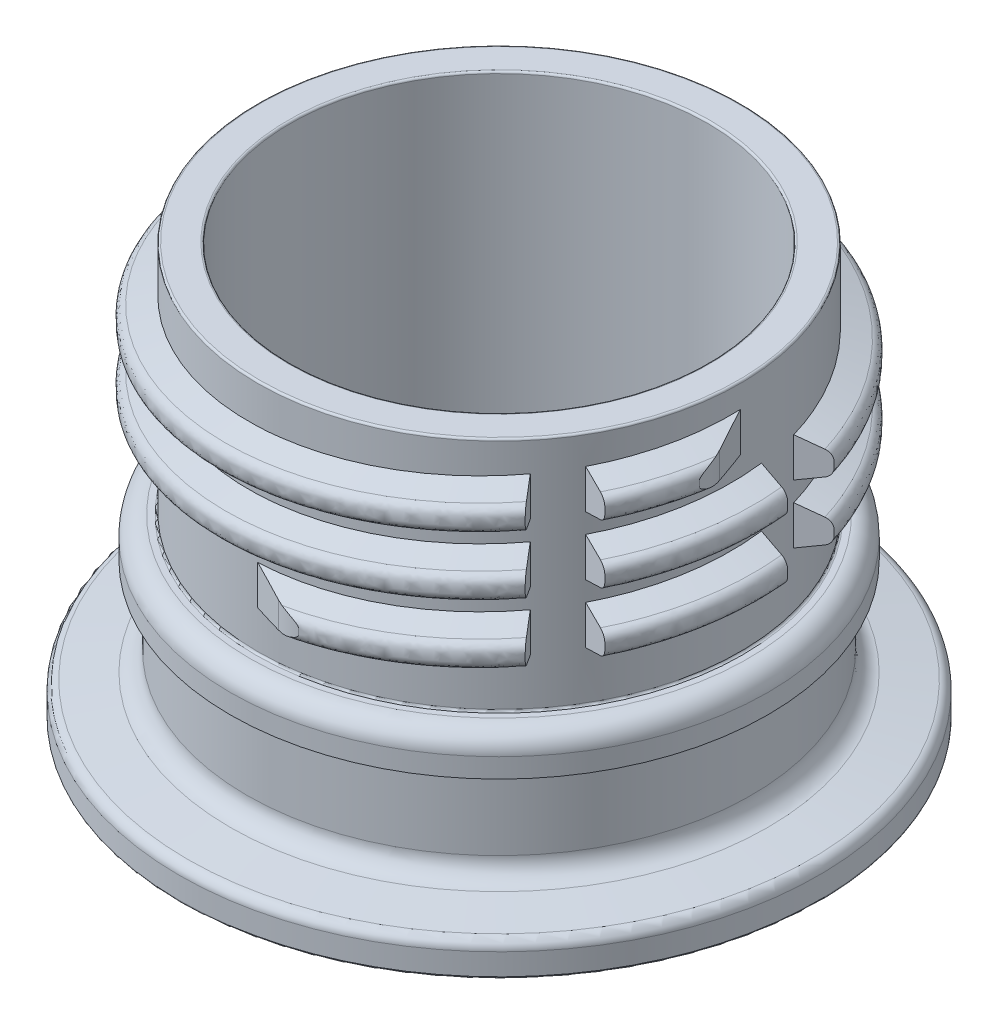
from build123d import *

# Parameters (mm, degrees)
BALAYAGE1_PITCH              = 3
BALAYAGE1_HEIGHT             = 6.75
BALAYAGE1_RADIUS             = 12.3
ENL_V_MAT_EXTRU_1_DEPTH      = 21.998675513
ENL_V_MAT_EXTRU_1_DEPTH_BACK = 21.998675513
ENL_V_MAT_EXTRU_2_DEPTH      = 1.5
ENL_V_MAT_EXTRU_2_DEPTH_BACK = 1.5
ENL_V_MAT_EXTRU_3_DEPTH      = 1.5
ENL_V_MAT_EXTRU_3_DEPTH_BACK = 1.5


with BuildPart() as part:
    # Balayage1: sweep along a helix
    with BuildLine() as balayage1_path:
        Helix(BALAYAGE1_PITCH, BALAYAGE1_HEIGHT, BALAYAGE1_RADIUS, center=(0, 0, 0), direction=(0, 1, 0))
    # Esquisse2 → Balayage1 (sweep)
    with BuildSketch(Plane.XY):
        with BuildLine():
            Line((12.299999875, 7.75), (12.299999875, 5.75))
            Line((12.299999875, 5.75), (13.458113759, 6.136037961))
            ThreePointArc((13.458113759, 6.136037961), (13.705620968, 6.318024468), (13.799999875, 6.61037961))
            Line((13.799999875, 6.61037961), (13.799999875, 6.88962039))
            ThreePointArc((13.799999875, 6.88962039), (13.705620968, 7.181975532), (13.458113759, 7.363962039))
            Line((13.458113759, 7.363962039), (12.299999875, 7.75))
        make_face()
    sweep(path=balayage1_path.line, is_frenet=True)

    # Esquisse3 → Enl_v. mat.-Extru.1 (cut, two sides: drawn at the far end of the back side and taken through both)
    with BuildSketch(Plane(origin=(0, 0, 0), x_dir=(1, 0, 0), z_dir=(0, 1, 0)).offset(-ENL_V_MAT_EXTRU_1_DEPTH_BACK)):
        Polygon((13.334220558, 3.848909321), (11.794343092, 3.069674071), (12.13469352, 1.139450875), (13.848219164, 0.933878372), align=None)
        Polygon((12.15030766, -6.707127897), (10.510447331, -6.169272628), (9.386237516, -7.774810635), (10.452521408, -9.131817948), align=None)
        Polygon((-12.15030766, 6.707127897), (-10.510447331, 6.169272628), (-9.386237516, 7.774810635), (-10.452521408, 9.131817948), align=None)
        Polygon((-13.334220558, -3.848909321), (-11.794343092, -3.069674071), (-12.13469352, -1.139450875), (-13.848219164, -0.933878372), align=None)
    extrude(amount=ENL_V_MAT_EXTRU_1_DEPTH + ENL_V_MAT_EXTRU_1_DEPTH_BACK, mode=Mode.SUBTRACT)


with BuildPart() as enl_v_mat_extru_1_piece_1:
    # of the separate pieces the step leaves, piece 1, a body of its own (enl_v_mat_extru_1_pieces)
    add(part.part.solids().sort_by_distance((-11.897274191, 6.372522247, 3.121761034))[0])



with BuildPart() as enl_v_mat_extru_1_piece_2:
    # of the separate pieces the step leaves, piece 2, a body of its own (enl_v_mat_extru_1_pieces)
    add(part.part.solids().sort_by_distance((11.89725975, 1.872523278, -3.121753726))[0])


with BuildPart() as enl_v_mat_extru_1_piece_3:
    # of the separate pieces the step leaves, piece 3, a body of its own (enl_v_mat_extru_1_pieces)
    add(part.part.solids().sort_by_distance((11.897213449, 4.872519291, -3.121730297))[0])


with BuildPart() as enl_v_mat_extru_1_piece_4:
    # of the separate pieces the step leaves, piece 4, a body of its own (enl_v_mat_extru_1_pieces)
    add(part.part.solids().sort_by_distance((-11.897258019, 3.372520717, 3.12175285))[0])


with BuildPart() as enl_v_mat_extru_1_piece_5:
    # of the separate pieces the step leaves, piece 5, a body of its own (enl_v_mat_extru_1_pieces)
    add(part.part.solids().sort_by_distance((0, 1, 12.299999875))[0])

    # Esquisse7 → Enl_v. mat.-Extru.3 (cut, two sides: drawn at the far end of the back side and taken through both)
    with BuildSketch(Plane(origin=(0, 0, 0), x_dir=(1, 0, 0), z_dir=(0, 1, 0)).offset(-ENL_V_MAT_EXTRU_3_DEPTH_BACK)):
        with BuildLine():
            Line((4.324597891, -14.386859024), (4.324597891, -13.245613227))
            Line((4.324597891, -13.245613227), (3.733181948, -13.364326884))
            ThreePointArc((3.733181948, -13.364326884), (2.807315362, -13.404182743), (1.913459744, -13.159561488))
            Line((1.913459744, -13.159561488), (0, -12.299999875))
            Line((0, -12.299999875), (0, -11.80006015))
            Line((0, -11.80006015), (-0.572118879, -11.80006015))
            Line((-0.572118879, -11.80006015), (-0.572118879, -14.386859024))
            Line((-0.572118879, -14.386859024), (4.324597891, -14.386859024))
        make_face()
    extrude(amount=ENL_V_MAT_EXTRU_3_DEPTH + ENL_V_MAT_EXTRU_3_DEPTH_BACK, mode=Mode.SUBTRACT)


with BuildPart() as enl_v_mat_extru_1_piece_6:
    # of the separate pieces the step leaves, piece 6, a body of its own (enl_v_mat_extru_1_pieces)
    add(part.part.solids().sort_by_distance((-10.619995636, 5.997520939, -6.205203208))[0])


with BuildPart() as enl_v_mat_extru_1_piece_7:
    # of the separate pieces the step leaves, piece 7, a body of its own (enl_v_mat_extru_1_pieces)
    add(part.part.solids().sort_by_distance((10.619996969, 1.497519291, 6.205203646))[0])


with BuildPart() as enl_v_mat_extru_1_piece_8:
    # of the separate pieces the step leaves, piece 8, a body of its own (enl_v_mat_extru_1_pieces)
    add(part.part.solids().sort_by_distance((-10.620061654, 2.997522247, -6.205224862))[0])


with BuildPart() as enl_v_mat_extru_1_piece_9:
    # of the separate pieces the step leaves, piece 9, a body of its own (enl_v_mat_extru_1_pieces)
    add(part.part.solids().sort_by_distance((10.620120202, 4.497521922, 6.205244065))[0])


with BuildPart() as enl_v_mat_extru_1_piece_10:
    # of the separate pieces the step leaves, piece 10, a body of its own (enl_v_mat_extru_1_pieces)
    add(part.part.solids().sort_by_distance((10.620085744, 7.497521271, 6.205232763))[0])

    # Esquisse5 → Enl_v. mat.-Extru.2 (cut, two sides: drawn at the far end of the back side and taken through both)
    with BuildSketch(Plane(origin=(0, 6.75, 0), x_dir=(-1, 0, 0), z_dir=(0, 1, 0)).offset(-ENL_V_MAT_EXTRU_2_DEPTH_BACK)):
        with BuildLine():
            Line((-12.299999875, 0), (-13.159561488, 1.913459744))
            ThreePointArc((-13.159561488, 1.913459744), (-13.404182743, 2.807315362), (-13.364326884, 3.733181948))
            Line((-13.364326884, 3.733181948), (-13.245613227, 4.324597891))
            Line((-13.245613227, 4.324597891), (-14.386859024, 4.324597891))
            Line((-14.386859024, 4.324597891), (-14.386859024, -0.572118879))
            Line((-14.386859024, -0.572118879), (-11.80006015, -0.572118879))
            Line((-11.80006015, -0.572118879), (-11.80006015, 0))
            Line((-11.80006015, 0), (-12.299999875, 0))
        make_face()
    extrude(amount=ENL_V_MAT_EXTRU_2_DEPTH + ENL_V_MAT_EXTRU_2_DEPTH_BACK, mode=Mode.SUBTRACT)


with BuildPart() as enl_v_mat_extru_1_piece_1_1:
    add(enl_v_mat_extru_1_piece_1.part)

    add(enl_v_mat_extru_1_piece_2.part)  # R_volution1 merges Enl_v. mat.-Extru.1 piece 2

    add(enl_v_mat_extru_1_piece_3.part)  # R_volution1 merges Enl_v. mat.-Extru.1 piece 3

    add(enl_v_mat_extru_1_piece_4.part)  # R_volution1 merges Enl_v. mat.-Extru.1 piece 4

    add(enl_v_mat_extru_1_piece_5.part)  # R_volution1 merges Enl_v. mat.-Extru.1 piece 5

    add(enl_v_mat_extru_1_piece_6.part)  # R_volution1 merges Enl_v. mat.-Extru.1 piece 6

    add(enl_v_mat_extru_1_piece_7.part)  # R_volution1 merges Enl_v. mat.-Extru.1 piece 7

    add(enl_v_mat_extru_1_piece_8.part)  # R_volution1 merges Enl_v. mat.-Extru.1 piece 8

    add(enl_v_mat_extru_1_piece_9.part)  # R_volution1 merges Enl_v. mat.-Extru.1 piece 9

    add(enl_v_mat_extru_1_piece_10.part)  # R_volution1 merges Enl_v. mat.-Extru.1 piece 10
    # Esquisse8 → R_volution1 (revolve)
    with BuildSketch(Plane(origin=(0, 0, 0), x_dir=(0, 0, -1), z_dir=(1, 0, 0))):
        with BuildLine():
            Line((-12.299999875, 0), (-12.299999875, 8.892385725))
            ThreePointArc((-12.299999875, 8.892385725), (-12.270710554, 8.963096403), (-12.199999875, 8.992385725))
            Line((-12.199999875, 8.992385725), (-10.749508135, 8.992385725))
            ThreePointArc((-10.749508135, 8.992385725), (-10.678797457, 8.963096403), (-10.649508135, 8.892385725))
            Line((-10.649508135, 8.892385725), (-10.649508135, -12.022643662))
            Line((-10.649508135, -12.022643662), (-16.193747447, -12.022643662))
            ThreePointArc((-16.193747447, -12.022643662), (-16.264458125, -11.99335434), (-16.293747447, -11.922643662))
            Line((-16.293747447, -11.922643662), (-16.293747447, -10.819842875))
            ThreePointArc((-16.293747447, -10.819842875), (-16.172793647, -10.493769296), (-15.868451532, -10.325455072))
            Line((-15.868451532, -10.325455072), (-13.700591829, -9.997882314))
            ThreePointArc((-13.700591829, -9.997882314), (-13.091907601, -9.661253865), (-12.85, -9.009106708))
            Line((-12.85, -9.009106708), (-12.85, -5.129466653))
            ThreePointArc((-12.85, -5.129466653), (-12.879289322, -5.058755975), (-12.95, -5.029466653))
            Line((-12.95, -5.029466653), (-13.702367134, -5.029466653))
            Line((-13.702367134, -5.029466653), (-13.702367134, -4.041558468))
            ThreePointArc((-13.702367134, -4.041558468), (-13.409473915, -3.334451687), (-12.702367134, -3.041558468))
            Line((-12.702367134, -3.041558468), (-12.399999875, -3.041558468))
            ThreePointArc((-12.399999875, -3.041558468), (-12.329289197, -3.012269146), (-12.299999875, -2.941558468))
            Line((-12.299999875, -2.941558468), (-12.299999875, 0))
        make_face()
    revolve(axis=Axis((0, 0, 0), (0, -1, 0)))


solid = enl_v_mat_extru_1_piece_1_1.part
